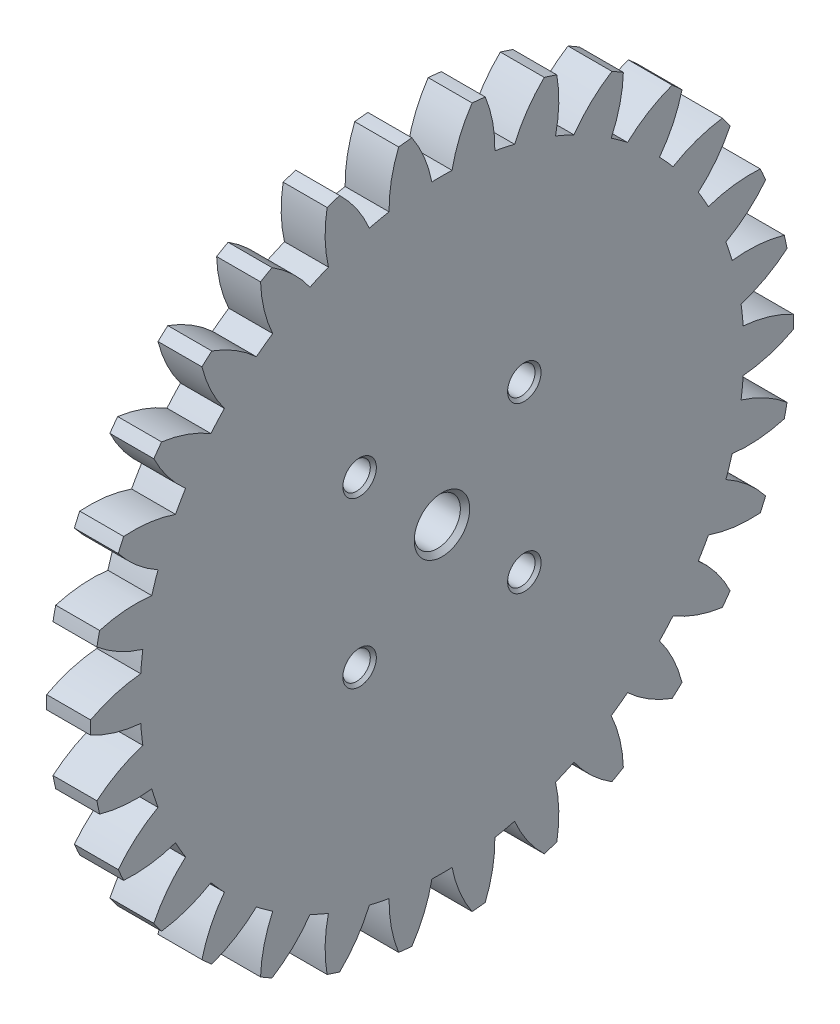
from build123d import *

# Parameters (mm, degrees)
BASPROSKE_W                  = 4
BASPROSKE_H                  = 32
TOOTHCUT_DEPTH               = 46.431266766
TEETHCUTS_COUNT              = 30
TEETHCUTS_ANGLE              = 348
BORSKE_R                     = 1
BORE_DEPTH                   = 50.0000508
HOLE_WIZARD_M3_1_D           = 2.5
HOLE_WIZARD_M3_1_DEPTH       = 7.5
HOLE_WIZARD_M3_1_CSINK_D     = 3.05
HOLE_WIZARD_M3_1_CSINK_ANGLE = 90
HOLE_WIZARD_M3_1_TIP         = 0.751075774
HOLE_WIZARD_M5_1_D           = 4.2
HOLE_WIZARD_M5_1_DEPTH       = 12.4
HOLE_WIZARD_M5_1_CSINK_D     = 5.05
HOLE_WIZARD_M5_1_CSINK_ANGLE = 90
HOLE_WIZARD_M5_1_TIP         = 1.2618073


with BuildPart() as part:
    # BasProSke → Base-Revolve (revolve)
    with BuildSketch(Plane(origin=(0, 0, 0), x_dir=(1, 0, 0), z_dir=(0, 1, 0)), mode=Mode.PRIVATE) as base_revolve_sk:
        with Locations((2, 16)):
            Rectangle(BASPROSKE_W, BASPROSKE_H)
    revolve(base_revolve_sk.sketch.rotate(Axis((-10, 0, 0), (1, 0, 0)), 180), axis=Axis((-10, 0, 0), (1, 0, 0)))

    # TooCutSke → ToothCut (cut, through all)
    with BuildSketch(Plane(origin=(0, 0, 0), x_dir=(0, 0, -1), z_dir=(1, 0, 0))):
        with BuildLine():
            ThreePointArc((0.918551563, 27.483654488), (0, 27.499), (-0.918551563, 27.483654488))
            ThreePointArc((-0.918551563, 27.483654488), (-1.617208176, 29.787801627), (-2.761784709, 31.906093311))
            ThreePointArc((-2.761784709, 31.906093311), (0, 32.0254), (2.761784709, 31.906093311))
            ThreePointArc((2.761784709, 31.906093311), (1.617208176, 29.787801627), (0.918551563, 27.483654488))
        make_face()
    toothcut = extrude(amount=TOOTHCUT_DEPTH, mode=Mode.SUBTRACT)

    # TeethCuts: ToothCut ×30 about axis
    teethcuts_axis = Axis((-10, 0, 0), (1, 0, 0))
    for i in range(1, TEETHCUTS_COUNT):
        add(toothcut.rotate(teethcuts_axis, i * TEETHCUTS_ANGLE / (TEETHCUTS_COUNT - 1)), mode=Mode.SUBTRACT)

    # BorSke → Bore (cut, symmetric)
    with BuildSketch(Plane(origin=(0, 0, 0), x_dir=(0, 0, -1), z_dir=(1, 0, 0))):
        with Locations(Location((0, 0, 0), (0, 0, 180))):
            Circle(BORSKE_R)
    extrude(amount=BORE_DEPTH, both=True, mode=Mode.SUBTRACT)

    # Hole Wizard M3 _1
    with Locations(Plane(origin=(4, 0, 0), x_dir=(0, 0, -1), z_dir=(1, 0, 0))):
        with Locations((7.5, 7.5), (-7.5, 7.5), (-7.5, -7.5), (7.5, -7.5)):
            CounterSinkHole(HOLE_WIZARD_M3_1_D / 2, HOLE_WIZARD_M3_1_CSINK_D / 2, depth=HOLE_WIZARD_M3_1_DEPTH, counter_sink_angle=HOLE_WIZARD_M3_1_CSINK_ANGLE)
            with Locations((0, 0, -(HOLE_WIZARD_M3_1_DEPTH + HOLE_WIZARD_M3_1_TIP / 2))):  # 118° drill point
                Cone(0, HOLE_WIZARD_M3_1_D / 2, HOLE_WIZARD_M3_1_TIP, mode=Mode.SUBTRACT)

    # Hole Wizard M5 _1
    with Locations(Plane(origin=(4, 0, 0), x_dir=(0, 0, -1), z_dir=(1, 0, 0))):
        with Locations((0, 0)):
            CounterSinkHole(HOLE_WIZARD_M5_1_D / 2, HOLE_WIZARD_M5_1_CSINK_D / 2, depth=HOLE_WIZARD_M5_1_DEPTH, counter_sink_angle=HOLE_WIZARD_M5_1_CSINK_ANGLE)
            with Locations((0, 0, -(HOLE_WIZARD_M5_1_DEPTH + HOLE_WIZARD_M5_1_TIP / 2))):  # 118° drill point
                Cone(0, HOLE_WIZARD_M5_1_D / 2, HOLE_WIZARD_M5_1_TIP, mode=Mode.SUBTRACT)


solid = part.part
